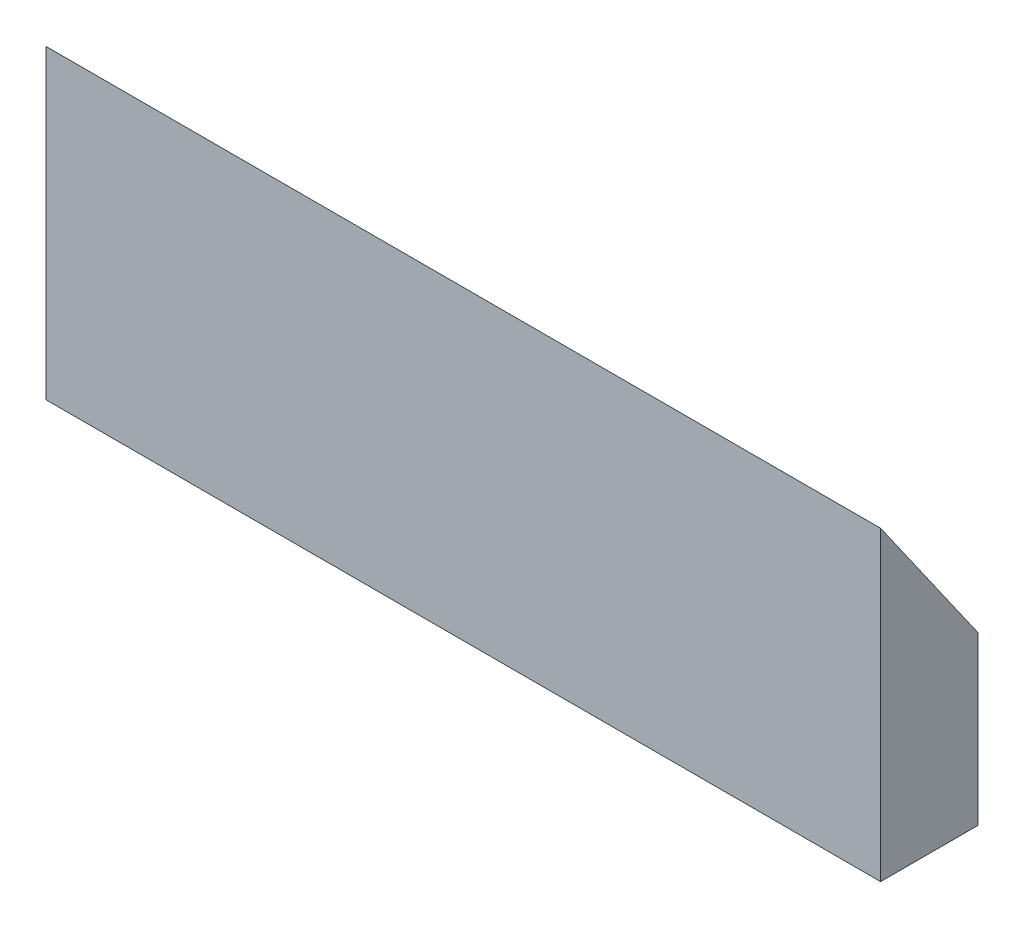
from build123d import *

# Parameters (mm, degrees)
SKETCH1_W           = 3
SKETCH1_H           = 0.6
BOSS_EXTRUDE1_DEPTH = 0.35
BOSS_EXTRUDE3_DEPTH = 3


with BuildPart() as part:
    # Sketch1 → Boss-Extrude1 (new body)
    with BuildSketch(Plane.XY):
        with Locations((1.5, -0.3)):
            Rectangle(SKETCH1_W, SKETCH1_H)
    extrude(amount=BOSS_EXTRUDE1_DEPTH)

    # Sketch3 → Boss-Extrude3 (add)
    with BuildSketch(Plane.ZY):
        Polygon((0.35, 0), (0.35, 0.5), (0, 0), align=None)
    extrude(amount=-BOSS_EXTRUDE3_DEPTH)


solid = part.part
